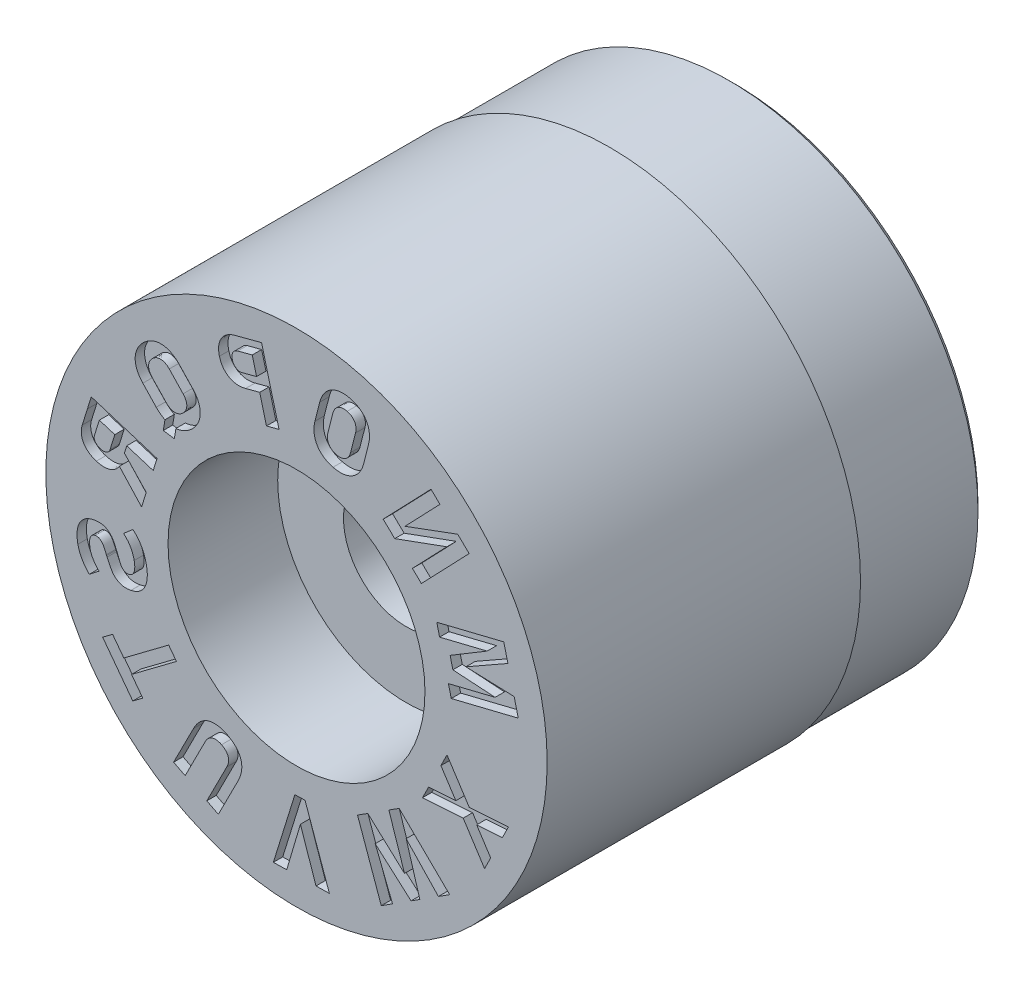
from build123d import *

# Parameters (mm, degrees)
SKETCH4_W          = 4
SKETCH4_H          = 1
CUT_EXTRUDE1_DEPTH = 0.3


with BuildPart() as part:
    # Sketch1 → Revolve1 (revolve)
    with BuildSketch(Plane(origin=(0, 0, 0), x_dir=(0, 0, -1), z_dir=(1, 0, 0)), mode=Mode.PRIVATE) as revolve1_sk:
        Polygon((0, 8), (0, 4.1), (3.5, 4.1), (3.5, 2), (14, 2), (14, 7.75), (13.75, 8), align=None)
    revolve(revolve1_sk.sketch.rotate(Axis((0, 0, 3.797909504), (0, 0, -1)), 90), axis=Axis((0, 0, 3.797909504), (0, 0, -1)))

    # Sketch4 → Cut-Revolve1 (revolve, cut)
    with BuildSketch(Plane(origin=(0, 0, 0), x_dir=(0, 0, -1), z_dir=(1, 0, 0)), mode=Mode.PRIVATE) as cut_revolve1_sk:
        with Locations((12, 8.435)):
            Rectangle(SKETCH4_W, SKETCH4_H)
    revolve(cut_revolve1_sk.sketch.rotate(Axis((0, 0, 0), (0, 0, -1)), 90), axis=Axis((0, 0, 0), (0, 0, -1)), mode=Mode.SUBTRACT)

    # Sketch6 → Cut-Extrude1 (cut)
    # profile 1 of 12: a face of its own
    with BuildSketch(Plane.XY):
        with BuildLine():
            add(Edge.make_bspline(
                [(-1.965228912, 6.820802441), (-2.027669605, 6.803893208), (-2.117857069, 6.771430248), (-2.224547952, 6.706108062), (-2.293665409, 6.649907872), (-2.353723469, 6.586716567), (-2.403129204, 6.516614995), (-2.441362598, 6.440165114), (-2.468949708, 6.358337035), (-2.485065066, 6.271958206), (-2.491609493, 6.149519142), (-2.475734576, 6.056826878), (-2.460282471, 5.995635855)],
                knots=[0, 0, 0, 0, 0.179476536, 0.263146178, 0.345423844, 0.425558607, 0.503885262, 0.582071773, 0.66151822, 0.742295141, 0.82474757, 1, 1, 1, 1], degree=3))
            add(Edge.make_bspline(
                [(-2.460282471, 5.995635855), (-2.444379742, 5.934477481), (-2.411500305, 5.846642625), (-2.345882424, 5.743255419), (-2.289451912, 5.676219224), (-2.225482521, 5.618657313), (-2.15454543, 5.571934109), (-2.077506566, 5.535120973), (-1.994242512, 5.509904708), (-1.906395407, 5.494923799), (-1.781395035, 5.491759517), (-1.686884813, 5.506795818), (-1.624244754, 5.523231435)],
                knots=[0, 0, 0, 0, 0.17551905, 0.257739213, 0.338753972, 0.417967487, 0.495681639, 0.57368959, 0.654075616, 0.736334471, 0.820262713, 1, 1, 1, 1], degree=3))
            Line((-1.624244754, 5.523231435), (-1.173858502, 5.641810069))
            Line((-1.173858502, 5.641810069), (-0.95771674, 4.819775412))
            Line((-0.95771674, 4.819775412), (-0.557998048, 4.924640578))
            Line((-0.557998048, 4.924640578), (-1.115303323, 7.044195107))
            Line((-1.115303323, 7.044195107), (-1.515022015, 6.93932994))
            Line((-1.515022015, 6.93932994), (-1.965228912, 6.820802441))
        make_face()
        with BuildLine():
            add(Edge.make_bspline(
                [(-1.735625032, 5.905345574), (-1.75822534, 5.899329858), (-1.792496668, 5.894446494), (-1.837853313, 5.897237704), (-1.870092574, 5.904183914), (-1.900775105, 5.915861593), (-1.92994226, 5.930834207), (-1.956224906, 5.951169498), (-1.980473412, 5.974941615), (-2.002429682, 6.002311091), (-2.02667756, 6.044941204), (-2.040136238, 6.079869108), (-2.046313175, 6.104452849)],
                knots=[0, 0, 0, 0, 0.169219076, 0.248096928, 0.327749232, 0.406804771, 0.485094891, 0.564039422, 0.646177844, 0.73044534, 0.816958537, 1, 1, 1, 1], degree=3))
            add(Edge.make_bspline(
                [(-2.046313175, 6.104452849), (-2.053532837, 6.129238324), (-2.058849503, 6.166765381), (-2.059367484, 6.216406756), (-2.053927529, 6.25115221), (-2.045654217, 6.284270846), (-2.031957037, 6.314520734), (-2.015143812, 6.342733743), (-1.993580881, 6.36756535), (-1.968697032, 6.389425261), (-1.930368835, 6.414842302), (-1.897247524, 6.426875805), (-1.874444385, 6.433202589)],
                knots=[0, 0, 0, 0, 0.18458373, 0.271052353, 0.355147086, 0.436297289, 0.51523441, 0.592529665, 0.671240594, 0.750119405, 0.8296662, 1, 1, 1, 1], degree=3))
            Line((-1.874444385, 6.433202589), (-1.413835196, 6.554494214))
            Line((-1.413835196, 6.554494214), (-1.275041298, 6.026630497))
            Line((-1.275041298, 6.026630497), (-1.735625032, 5.905345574))
        make_face(mode=Mode.SUBTRACT)
    # profile 2 of 12: a face of its own
    with BuildSketch(Plane.XY):
        with BuildLine():
            Line((-3.898808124, 2.99632497), (-3.848131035, 3.305995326))
            add(Edge.make_bspline(
                [(-3.848131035, 3.305995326), (-3.836792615, 3.30666712), (-3.808727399, 3.308923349), (-3.76389009, 3.316186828), (-3.713731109, 3.327202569), (-3.664013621, 3.342340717), (-3.614915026, 3.360230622), (-3.566897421, 3.382208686), (-3.519676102, 3.407628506), (-3.473386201, 3.436632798), (-3.412052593, 3.480297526), (-3.36871918, 3.517501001), (-3.340797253, 3.543995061)],
                knots=[0.553499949, 0.553499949, 0.553499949, 0.553499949, 0.580086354, 0.619413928, 0.659745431, 0.700258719, 0.74101763, 0.782026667, 0.823799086, 0.866516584, 0.909857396, 1, 1, 1, 1], degree=3))
            add(Edge.make_bspline(
                [(-3.340797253, 3.543995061), (-3.312558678, 3.570190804), (-3.273318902, 3.611901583), (-3.226667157, 3.671047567), (-3.195497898, 3.715946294), (-3.167230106, 3.761432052), (-3.143386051, 3.808577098), (-3.122255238, 3.856382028), (-3.104941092, 3.905319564), (-3.091162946, 3.954710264), (-3.0808539, 4.004408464), (-3.074020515, 4.054167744), (-3.071757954, 4.104155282), (-3.071897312, 4.154171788), (-3.076831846, 4.204157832), (-3.084373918, 4.254441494), (-3.096105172, 4.304561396), (-3.11163789, 4.354297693), (-3.129980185, 4.403650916), (-3.152902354, 4.451817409), (-3.178562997, 4.499436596), (-3.207760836, 4.546100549), (-3.252042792, 4.608031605), (-3.289792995, 4.652001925), (-3.316725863, 4.680383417)],
                knots=[0, 0, 0, 0, 0.090196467, 0.133907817, 0.176363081, 0.218191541, 0.259249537, 0.300021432, 0.340564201, 0.380741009, 0.420055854, 0.459394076, 0.498255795, 0.537194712, 0.576458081, 0.615802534, 0.656246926, 0.696896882, 0.737812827, 0.77947539, 0.821746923, 0.864482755, 0.90833409, 1, 1, 1, 1], degree=3))
            Line((-3.316725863, 4.680383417), (-3.74388665, 5.130616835))
            add(Edge.make_bspline(
                [(-3.74388665, 5.130616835), (-3.770222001, 5.159500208), (-3.81291853, 5.198578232), (-3.872411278, 5.24619899), (-3.917217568, 5.278430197), (-3.963631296, 5.306189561), (-4.010475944, 5.331545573), (-4.058678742, 5.352720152), (-4.107658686, 5.370674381), (-4.157187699, 5.384857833), (-4.206837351, 5.395779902), (-4.256809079, 5.40212696), (-4.306709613, 5.40604489), (-4.356685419, 5.405124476), (-4.406738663, 5.401715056), (-4.456773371, 5.393847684), (-4.506882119, 5.382581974), (-4.556474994, 5.367549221), (-4.605570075, 5.349642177), (-4.653588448, 5.327668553), (-4.700810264, 5.302248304), (-4.747097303, 5.273241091), (-4.808532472, 5.229531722), (-4.851868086, 5.192170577), (-4.88013629, 5.165904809)],
                knots=[0, 0, 0, 0, 0.0914447, 0.13535298, 0.178471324, 0.220602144, 0.261946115, 0.303163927, 0.34380239, 0.384051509, 0.423761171, 0.462745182, 0.501957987, 0.540891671, 0.579708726, 0.619390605, 0.659396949, 0.699922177, 0.740693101, 0.781714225, 0.823498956, 0.866229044, 0.90958263, 1, 1, 1, 1], degree=3))
            add(Edge.make_bspline(
                [(-4.88013629, 5.165904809), (-4.907918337, 5.139265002), (-4.947443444, 5.09802481), (-4.994484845, 5.039170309), (-5.025268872, 4.99422696), (-5.053191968, 4.948572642), (-5.077637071, 4.901898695), (-5.098618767, 4.85394683), (-5.115976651, 4.805031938), (-5.129791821, 4.755497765), (-5.140054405, 4.705779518), (-5.146715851, 4.655878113), (-5.149996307, 4.60590851), (-5.148630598, 4.555779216), (-5.144914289, 4.505676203), (-5.136359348, 4.455513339), (-5.124792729, 4.405214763), (-5.109437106, 4.35525679), (-5.090864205, 4.305929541), (-5.068607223, 4.257532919), (-5.042804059, 4.210056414), (-5.013654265, 4.163370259), (-4.96935461, 4.101447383), (-4.931615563, 4.057471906), (-4.904678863, 4.029092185)],
                knots=[0, 0, 0, 0, 0.090160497, 0.133576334, 0.176319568, 0.217664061, 0.258857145, 0.299619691, 0.340153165, 0.38032076, 0.419972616, 0.458952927, 0.498157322, 0.537110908, 0.576316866, 0.615725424, 0.656160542, 0.697129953, 0.738036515, 0.779525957, 0.821787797, 0.86451383, 0.908355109, 1, 1, 1, 1], degree=3))
            Line((-4.904678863, 4.029092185), (-4.477518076, 3.578858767))
            add(Edge.make_bspline(
                [(-4.477518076, 3.578858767), (-4.451184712, 3.549971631), (-4.408482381, 3.510904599), (-4.348998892, 3.463266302), (-4.304167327, 3.431082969), (-4.257898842, 3.40318279), (-4.222191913, 3.38446494), (-4.202019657, 3.374934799), (-4.197735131, 3.372956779)],
                knots=[0, 0, 0, 0, 0.091417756, 0.135313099, 0.178418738, 0.220537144, 0.261722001, 0.272770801, 0.272770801, 0.272770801, 0.272770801], degree=3))
            Line((-4.197735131, 3.372956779), (-4.25122275, 3.048011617))
            Line((-4.25122275, 3.048011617), (-3.898808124, 2.99632497))
        make_face()
        with BuildLine():
            Line((-4.061062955, 4.843741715), (-3.619430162, 4.378383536))
            add(Edge.make_bspline(
                [(-3.619430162, 4.378383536), (-3.594708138, 4.35211299), (-3.561810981, 4.309944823), (-3.529908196, 4.247915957), (-3.512665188, 4.201131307), (-3.503244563, 4.153490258), (-3.500094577, 4.105904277), (-3.503993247, 4.058780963), (-3.514520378, 4.012101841), (-3.532397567, 3.966696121), (-3.565574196, 3.907208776), (-3.5996465, 3.867683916), (-3.625005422, 3.843522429)],
                knots=[0, 0, 0, 0, 0.1797866, 0.264153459, 0.346527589, 0.427206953, 0.505113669, 0.58328295, 0.661826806, 0.742543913, 0.825414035, 1, 1, 1, 1], degree=3))
            add(Edge.make_bspline(
                [(-3.625005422, 3.843522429), (-3.650838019, 3.819714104), (-3.691526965, 3.78664743), (-3.753151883, 3.757436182), (-3.799450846, 3.742040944), (-3.846633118, 3.733826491), (-3.894047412, 3.731978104), (-3.941233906, 3.737842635), (-3.987998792, 3.750269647), (-4.033864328, 3.769338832), (-4.094029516, 3.804837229), (-4.134835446, 3.83951024), (-4.159422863, 3.866134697)],
                knots=[0, 0, 0, 0, 0.175488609, 0.257693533, 0.338212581, 0.417590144, 0.495224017, 0.573485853, 0.653269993, 0.735363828, 0.819848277, 1, 1, 1, 1], degree=3))
            Line((-4.159422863, 3.866134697), (-4.601055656, 4.331492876))
            add(Edge.make_bspline(
                [(-4.601055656, 4.331492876), (-4.62618204, 4.357565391), (-4.659022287, 4.399882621), (-4.691082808, 4.461970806), (-4.708031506, 4.508708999), (-4.718369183, 4.556053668), (-4.721228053, 4.603575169), (-4.717527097, 4.650890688), (-4.706348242, 4.697613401), (-4.688587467, 4.742990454), (-4.655795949, 4.802728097), (-4.621238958, 4.84193479), (-4.595928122, 4.86637744)],
                knots=[0, 0, 0, 0, 0.180140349, 0.264432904, 0.346734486, 0.426812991, 0.504651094, 0.582751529, 0.662087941, 0.742733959, 0.824536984, 1, 1, 1, 1], degree=3))
            add(Edge.make_bspline(
                [(-4.595928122, 4.86637744), (-4.570463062, 4.890636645), (-4.529037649, 4.922396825), (-4.467925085, 4.952607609), (-4.42159703, 4.967688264), (-4.374626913, 4.976358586), (-4.32736217, 4.977167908), (-4.279985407, 4.972240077), (-4.233067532, 4.959654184), (-4.187071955, 4.940567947), (-4.126793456, 4.905010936), (-4.085981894, 4.870184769), (-4.061062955, 4.843741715)],
                knots=[0, 0, 0, 0, 0.174978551, 0.257511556, 0.338000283, 0.41662375, 0.494167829, 0.572354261, 0.65283612, 0.73489904, 0.819351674, 1, 1, 1, 1], degree=3))
        make_face(mode=Mode.SUBTRACT)
    # profile 3 of 12: a face of its own
    with BuildSketch(Plane.XY):
        with BuildLine():
            Line((-5.492865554, 1.801806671), (-5.418265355, 2.041869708))
            Line((-5.418265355, 2.041869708), (-4.573896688, 1.77964272))
            Line((-4.573896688, 1.77964272), (-4.451133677, 2.175242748))
            Line((-4.451133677, 2.175242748), (-6.55129686, 2.827469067))
            Line((-6.55129686, 2.827469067), (-6.674059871, 2.431869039))
            Line((-6.674059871, 2.431869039), (-6.673924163, 2.431826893))
            Line((-6.673924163, 2.431826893), (-6.836694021, 1.90803437))
            add(Edge.make_bspline(
                [(-6.836694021, 1.90803437), (-6.854124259, 1.853272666), (-6.869861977, 1.76951945), (-6.868384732, 1.658193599), (-6.855413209, 1.579110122), (-6.831343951, 1.503596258), (-6.797315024, 1.432220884), (-6.752244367, 1.366177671), (-6.697310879, 1.305514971), (-6.632723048, 1.251060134), (-6.533180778, 1.185050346), (-6.447648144, 1.151459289), (-6.388794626, 1.132454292)],
                knots=[0, 0, 0, 0, 0.170945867, 0.251282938, 0.330228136, 0.408509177, 0.4863951, 0.564684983, 0.645585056, 0.729174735, 0.815467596, 1, 1, 1, 1], degree=3))
            add(Edge.make_bspline(
                [(-6.388794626, 1.132454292), (-6.329832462, 1.113956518), (-6.240421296, 1.094817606), (-6.121394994, 1.091630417), (-6.037411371, 1.10063539), (-5.957823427, 1.119740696), (-5.883010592, 1.148386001), (-5.814592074, 1.1884327), (-5.751946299, 1.237351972), (-5.69727695, 1.293924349), (-5.666971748, 1.336269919), (-5.653565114, 1.357693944)],
                knots=[0, 0, 0, 0, 0.184189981, 0.270383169, 0.35373301, 0.435075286, 0.513611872, 0.591479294, 0.670334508, 0.749749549, 0.824975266, 0.824975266, 0.824975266, 0.824975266], degree=3))
            Line((-5.653565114, 1.357693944), (-4.944014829, 0.587025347))
            Line((-4.944014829, 0.587025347), (-4.795111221, 1.066422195))
            Line((-4.795111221, 1.066422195), (-5.492865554, 1.801806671))
        make_face()
        with BuildLine():
            Line((-6.293269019, 2.313610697), (-5.799511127, 2.16026933))
            Line((-5.799511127, 2.16026933), (-5.952642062, 1.667694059))
            add(Edge.make_bspline(
                [(-5.952642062, 1.667694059), (-5.957948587, 1.648236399), (-5.970874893, 1.621207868), (-5.994526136, 1.589680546), (-6.015438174, 1.569777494), (-6.039072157, 1.553071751), (-6.065216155, 1.539633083), (-6.094066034, 1.530750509), (-6.124831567, 1.525116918), (-6.157463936, 1.522972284), (-6.204050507, 1.525701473), (-6.239257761, 1.532529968), (-6.262627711, 1.539319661)],
                knots=[0, 0, 0, 0, 0.160082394, 0.236396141, 0.313016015, 0.389134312, 0.466417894, 0.546230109, 0.628768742, 0.715268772, 0.806175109, 1, 1, 1, 1], degree=3))
            add(Edge.make_bspline(
                [(-6.262627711, 1.539319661), (-6.28571981, 1.546841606), (-6.319058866, 1.559810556), (-6.358851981, 1.584063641), (-6.38446639, 1.604449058), (-6.406566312, 1.626706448), (-6.425343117, 1.650477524), (-6.439719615, 1.676217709), (-6.450000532, 1.703463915), (-6.45571744, 1.731841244), (-6.458550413, 1.771559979), (-6.452035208, 1.801519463), (-6.446397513, 1.821043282)],
                knots=[0, 0, 0, 0, 0.193075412, 0.282174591, 0.368977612, 0.452272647, 0.530685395, 0.608675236, 0.685354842, 0.760869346, 0.837759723, 1, 1, 1, 1], degree=3))
            Line((-6.446397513, 1.821043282), (-6.293269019, 2.313610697))
        make_face(mode=Mode.SUBTRACT)
    # profile 4 of 12: a face of its own
    with BuildSketch(Plane.XY):
        with BuildLine():
            Line((0.74185494, 6.327821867), (0.588099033, 5.724645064))
            add(Edge.make_bspline(
                [(0.588099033, 5.724645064), (0.578232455, 5.686753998), (0.567465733, 5.629720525), (0.557922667, 5.553813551), (0.555566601, 5.498501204), (0.556040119, 5.444251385), (0.559980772, 5.391023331), (0.567780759, 5.338720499), (0.57865632, 5.287532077), (0.593434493, 5.237881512), (0.610513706, 5.189822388), (0.631288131, 5.143781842), (0.6555381, 5.099835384), (0.682356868, 5.057344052), (0.712232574, 5.016722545), (0.745892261, 4.978524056), (0.781949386, 4.94174782), (0.821430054, 4.907757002), (0.862792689, 4.875562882), (0.907439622, 4.846989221), (0.954070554, 4.820536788), (1.00309194, 4.7963234), (1.072850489, 4.767486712), (1.127676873, 4.750321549), (1.165272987, 4.740944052)],
                knots=[0, 0, 0, 0, 0.09133961, 0.135404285, 0.178489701, 0.2204833, 0.26201778, 0.302985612, 0.343862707, 0.384085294, 0.423845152, 0.462863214, 0.501862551, 0.540942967, 0.580112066, 0.619442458, 0.65971949, 0.700257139, 0.740985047, 0.781988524, 0.823881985, 0.866114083, 0.909549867, 1, 1, 1, 1], degree=3))
            add(Edge.make_bspline(
                [(1.165272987, 4.740944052), (1.202963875, 4.731961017), (1.259202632, 4.719478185), (1.334440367, 4.711924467), (1.3890191, 4.709120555), (1.442688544, 4.709979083), (1.495516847, 4.714082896), (1.547426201, 4.722096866), (1.598207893, 4.733208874), (1.647609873, 4.748106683), (1.695215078, 4.765891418), (1.741141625, 4.786973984), (1.78498007, 4.811209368), (1.826983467, 4.838897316), (1.86722734, 4.869340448), (1.905626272, 4.903031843), (1.942051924, 4.939772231), (1.976382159, 4.979258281), (2.008097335, 5.021508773), (2.037162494, 5.066318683), (2.063357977, 5.113803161), (2.087322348, 5.163586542), (2.116961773, 5.234011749), (2.133203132, 5.289814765), (2.143334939, 5.32764774)],
                knots=[0, 0, 0, 0, 0.090553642, 0.134089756, 0.176390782, 0.218072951, 0.259307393, 0.299989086, 0.340594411, 0.380562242, 0.42034234, 0.459141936, 0.49842787, 0.53715996, 0.576489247, 0.616140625, 0.656308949, 0.697181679, 0.738191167, 0.779537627, 0.821765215, 0.864700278, 0.908478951, 1, 1, 1, 1], degree=3))
            Line((2.143334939, 5.32764774), (2.297090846, 5.930824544))
            add(Edge.make_bspline(
                [(2.297090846, 5.930824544), (2.306958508, 5.968715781), (2.317722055, 6.025748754), (2.327270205, 6.101656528), (2.32961244, 6.156966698), (2.329188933, 6.211224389), (2.325072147, 6.264336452), (2.317963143, 6.316659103), (2.306717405, 6.367781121), (2.292693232, 6.417670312), (2.274731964, 6.465510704), (2.254732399, 6.511879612), (2.230172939, 6.555620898), (2.204019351, 6.598317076), (2.173358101, 6.638349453), (2.140348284, 6.677021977), (2.103784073, 6.713322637), (2.064604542, 6.747356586), (2.023088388, 6.779366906), (1.9788412, 6.808559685), (1.932030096, 6.835091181), (1.882569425, 6.858734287), (1.812796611, 6.887908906), (1.757831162, 6.904716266), (1.720314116, 6.91431766)],
                knots=[0, 0, 0, 0, 0.091341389, 0.135406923, 0.178493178, 0.220487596, 0.262022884, 0.302787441, 0.343665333, 0.384140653, 0.423666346, 0.462901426, 0.501901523, 0.540680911, 0.579699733, 0.619483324, 0.65932349, 0.699861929, 0.740590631, 0.781629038, 0.823523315, 0.866115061, 0.909551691, 1, 1, 1, 1], degree=3))
            add(Edge.make_bspline(
                [(1.720314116, 6.91431766), (1.682992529, 6.924535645), (1.626615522, 6.93499756), (1.551583, 6.943631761), (1.496836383, 6.946678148), (1.443091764, 6.945238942), (1.390351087, 6.940897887), (1.33854697, 6.9330011), (1.287707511, 6.921699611), (1.238241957, 6.907378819), (1.190602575, 6.889351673), (1.144771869, 6.868395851), (1.100670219, 6.844453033), (1.058820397, 6.816744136), (1.018573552, 6.786315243), (0.98002814, 6.752564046), (0.943675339, 6.715554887), (0.90915901, 6.676036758), (0.877619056, 6.633650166), (0.847894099, 6.589255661), (0.821870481, 6.541641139), (0.797856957, 6.491890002), (0.76823555, 6.421452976), (0.751982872, 6.365657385), (0.74185494, 6.327821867)],
                knots=[0, 0, 0, 0, 0.090234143, 0.133639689, 0.17625437, 0.218101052, 0.259037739, 0.299716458, 0.340318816, 0.380534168, 0.41981878, 0.459104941, 0.498097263, 0.536826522, 0.576152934, 0.615801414, 0.656300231, 0.697169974, 0.738176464, 0.77955374, 0.821778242, 0.864710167, 0.90848564, 1, 1, 1, 1], degree=3))
        make_face()
        with BuildLine():
            Line((1.884333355, 6.047162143), (1.724986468, 5.42363406))
            add(Edge.make_bspline(
                [(1.724986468, 5.42363406), (1.715837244, 5.388477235), (1.697526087, 5.337875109), (1.66190347, 5.277424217), (1.631164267, 5.238037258), (1.596371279, 5.20390792), (1.557194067, 5.176458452), (1.515063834, 5.154453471), (1.469778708, 5.138464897), (1.42169602, 5.129887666), (1.353581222, 5.125498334), (1.301837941, 5.134394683), (1.26756284, 5.142330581)],
                knots=[0, 0, 0, 0, 0.180265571, 0.264874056, 0.347008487, 0.427398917, 0.505624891, 0.583343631, 0.662522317, 0.742738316, 0.824849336, 1, 1, 1, 1], degree=3))
            add(Edge.make_bspline(
                [(1.26756284, 5.142330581), (1.233496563, 5.151314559), (1.184220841, 5.169067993), (1.126007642, 5.204898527), (1.088465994, 5.236287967), (1.05626572, 5.271829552), (1.029847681, 5.311365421), (1.008972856, 5.354236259), (0.99451692, 5.400757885), (0.986699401, 5.450048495), (0.983587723, 5.520203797), (0.992838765, 5.573334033), (1.001461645, 5.608496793)],
                knots=[0, 0, 0, 0, 0.174984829, 0.257482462, 0.337888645, 0.416930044, 0.494550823, 0.57298153, 0.65265653, 0.735237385, 0.819920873, 1, 1, 1, 1], degree=3))
            Line((1.001461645, 5.608496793), (1.160808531, 6.232024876))
            add(Edge.make_bspline(
                [(1.160808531, 6.232024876), (1.1706143, 6.266869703), (1.187229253, 6.318175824), (1.223943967, 6.377844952), (1.254355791, 6.417281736), (1.289263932, 6.451182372), (1.327968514, 6.479155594), (1.370143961, 6.501016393), (1.415516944, 6.516915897), (1.463587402, 6.526099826), (1.53178508, 6.530253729), (1.583488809, 6.521647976), (1.617627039, 6.513139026)],
                knots=[0, 0, 0, 0, 0.180450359, 0.264422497, 0.346616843, 0.427065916, 0.505014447, 0.582789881, 0.662026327, 0.742762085, 0.824933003, 1, 1, 1, 1], degree=3))
            add(Edge.make_bspline(
                [(1.617627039, 6.513139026), (1.652065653, 6.505106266), (1.700874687, 6.486216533), (1.759185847, 6.450598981), (1.796762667, 6.419199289), (1.82872208, 6.383597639), (1.855887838, 6.344508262), (1.875999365, 6.301108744), (1.891037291, 6.254765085), (1.899320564, 6.205568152), (1.901202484, 6.135532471), (1.893625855, 6.082351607), (1.884333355, 6.047162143)],
                knots=[0, 0, 0, 0, 0.175068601, 0.257563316, 0.337966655, 0.417005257, 0.494272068, 0.573143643, 0.653341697, 0.735328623, 0.819641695, 1, 1, 1, 1], degree=3))
        make_face(mode=Mode.SUBTRACT)
    # profile 5 of 12: a face of its own
    with BuildSketch(Plane.XY):
        Polygon((3.698792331, 3.212255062), (3.985757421, 2.937022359), (5.51139954, 4.52724692), (5.144638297, 4.879154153), (3.460985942, 4.256829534), (4.578646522, 5.421860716), (4.292147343, 5.696663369), (2.766505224, 4.106438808), (3.135130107, 3.752811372), (4.798532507, 4.358802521), align=None)
    # profile 6 of 12: a face of its own
    with BuildSketch(Plane.XY):
        Polygon((6.946849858, 1.2929693), (5.40516638, 1.34508153), (6.746399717, 2.107480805), (6.615723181, 2.638711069), (4.477032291, 2.112342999), (4.566980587, 1.74600869), (6.085205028, 2.119407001), (4.902630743, 1.410054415), (4.990182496, 1.05410404), (6.338693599, 0.968114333), (4.848887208, 0.601705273), (4.938835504, 0.235370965), (7.077526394, 0.761739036), align=None)
    # profile 7 of 12: a face of its own
    with BuildSketch(Plane.XY):
        Polygon((4.21433986, -2.575908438), (4.019242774, -2.96861894), (5.319760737, -2.879839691), (6.002380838, -3.934316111), (6.197477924, -3.541605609), (5.749703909, -2.850450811), (6.569312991, -2.794301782), (6.764410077, -2.401591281), (5.513738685, -2.486816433), (4.803894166, -1.390042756), (4.60879708, -1.782753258), (5.084329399, -2.516195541), align=None)
    # profile 8 of 12: a face of its own
    with BuildSketch(Plane.XY):
        Polygon((3.064173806, -6.377740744), (2.511931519, -4.989471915), (3.656326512, -5.998672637), (3.936159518, -5.819639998), (3.500314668, -4.357381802), (4.528718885, -5.440760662), (4.887917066, -5.211080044), (3.276852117, -3.632331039), (2.947976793, -3.842475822), (3.447203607, -5.346018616), (2.275863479, -4.272409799), (1.947394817, -4.482743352), (2.704975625, -6.607421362), align=None)
    # profile 9 of 12: a face of its own
    with BuildSketch(Plane.XY):
        Polygon((0.272622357, -4.910983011), (-0.051530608, -4.917522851), (-0.739380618, -7.132269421), (-0.312552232, -7.123769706), (0.125048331, -5.646634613), (0.62224102, -7.104794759), (1.049069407, -7.096295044), align=None)
    # profile 10 of 12: a face of its own
    with BuildSketch(Plane.XY):
        with BuildLine():
            Line((-2.494128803, -6.681305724), (-1.860236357, -5.433554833))
            add(Edge.make_bspline(
                [(-1.860236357, -5.433554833), (-1.841860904, -5.396436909), (-1.816023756, -5.340916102), (-1.789053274, -5.265209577), (-1.772766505, -5.210115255), (-1.760102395, -5.155839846), (-1.75110411, -5.102368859), (-1.745811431, -5.049712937), (-1.743987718, -4.997728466), (-1.746641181, -4.946735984), (-1.751696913, -4.896801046), (-1.761060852, -4.848054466), (-1.774049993, -4.800733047), (-1.791126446, -4.754613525), (-1.811079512, -4.709531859), (-1.83538307, -4.665954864), (-1.862986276, -4.623596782), (-1.894070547, -4.582664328), (-1.928501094, -4.543277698), (-1.966121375, -4.505415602), (-2.007597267, -4.469612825), (-2.052210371, -4.435073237), (-2.117458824, -4.390616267), (-2.169511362, -4.360430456), (-2.206052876, -4.342325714)],
                knots=[0, 0, 0, 0, 0.095524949, 0.140911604, 0.185147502, 0.227894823, 0.269309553, 0.310049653, 0.349812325, 0.38908245, 0.427668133, 0.465422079, 0.503364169, 0.540653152, 0.578693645, 0.616894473, 0.655533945, 0.695157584, 0.735267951, 0.776048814, 0.818086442, 0.861479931, 0.906043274, 1, 1, 1, 1], degree=3))
            add(Edge.make_bspline(
                [(-2.206052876, -4.342325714), (-2.242565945, -4.324216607), (-2.297231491, -4.298947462), (-2.371586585, -4.272450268), (-2.425813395, -4.257130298), (-2.47913835, -4.244736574), (-2.531908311, -4.236494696), (-2.583982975, -4.232431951), (-2.635198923, -4.231361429), (-2.685503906, -4.234176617), (-2.734782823, -4.240642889), (-2.782884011, -4.250854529), (-2.829855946, -4.264522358), (-2.875728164, -4.281694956), (-2.920117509, -4.303466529), (-2.963848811, -4.327824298), (-3.005918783, -4.356666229), (-3.046718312, -4.388668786), (-3.086041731, -4.424201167), (-3.123767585, -4.462919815), (-3.16007978, -4.505133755), (-3.194575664, -4.550963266), (-3.239319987, -4.617794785), (-3.269529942, -4.671110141), (-3.288198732, -4.708160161)],
                knots=[0, 0, 0, 0, 0.094114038, 0.138797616, 0.182063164, 0.224120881, 0.265100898, 0.305212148, 0.34460795, 0.383264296, 0.421395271, 0.459223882, 0.496654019, 0.534231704, 0.572121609, 0.610674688, 0.649680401, 0.689720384, 0.730293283, 0.771920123, 0.81442815, 0.858737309, 0.90424292, 1, 1, 1, 1], degree=3))
            Line((-3.288198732, -4.708160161), (-3.922091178, -5.955911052))
            Line((-3.922091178, -5.955911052), (-3.553647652, -6.143048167))
            Line((-3.553647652, -6.143048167), (-2.915066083, -4.885759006))
            add(Edge.make_bspline(
                [(-2.915066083, -4.885759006), (-2.901393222, -4.85945441), (-2.879611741, -4.821540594), (-2.844334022, -4.777006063), (-2.817647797, -4.747593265), (-2.788767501, -4.722579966), (-2.75820867, -4.701557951), (-2.72645343, -4.683392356), (-2.692632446, -4.670226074), (-2.657880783, -4.660269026), (-2.622093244, -4.654623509), (-2.585474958, -4.653353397), (-2.548097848, -4.65547681), (-2.509759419, -4.662173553), (-2.456367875, -4.677453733), (-2.416742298, -4.693363), (-2.390991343, -4.706939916)],
                knots=[0, 0, 0, 0, 0.141478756, 0.207311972, 0.270439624, 0.33046649, 0.3888791, 0.447000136, 0.504343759, 0.561354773, 0.619002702, 0.67647883, 0.735654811, 0.797097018, 0.861493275, 1, 1, 1, 1], degree=3))
            add(Edge.make_bspline(
                [(-2.390991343, -4.706939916), (-2.364796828, -4.720108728), (-2.328115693, -4.742405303), (-2.284124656, -4.776929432), (-2.256058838, -4.804040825), (-2.231325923, -4.832691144), (-2.211344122, -4.863671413), (-2.194013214, -4.895855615), (-2.181667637, -4.930059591), (-2.172335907, -4.965206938), (-2.167935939, -5.001560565), (-2.166737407, -5.03877187), (-2.1702712, -5.076875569), (-2.177757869, -5.115743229), (-2.192735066, -5.170419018), (-2.210369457, -5.210428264), (-2.22399076, -5.236879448)],
                knots=[0, 0, 0, 0, 0.139145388, 0.203188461, 0.265137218, 0.324189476, 0.382447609, 0.439852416, 0.497362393, 0.554683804, 0.612167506, 0.670826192, 0.731173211, 0.793426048, 0.858591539, 1, 1, 1, 1], degree=3))
            Line((-2.22399076, -5.236879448), (-2.862572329, -6.494168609))
            Line((-2.862572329, -6.494168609), (-2.494128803, -6.681305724))
        make_face()
    # profile 11 of 12: a face of its own
    with BuildSketch(Plane.XY):
        Polygon((-5.511301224, -3.869996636), (-5.868747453, -3.39350658), (-6.187148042, -3.631916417), (-5.224947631, -4.914567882), (-4.906547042, -4.676158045), (-5.263944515, -4.199732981), (-3.831789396, -3.125586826), (-4.07899046, -2.795733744), align=None)
    # profile 12 of 12: a face of its own
    with BuildSketch(Plane.XY):
        with BuildLine():
            Line((-5.284909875, -1.8861092), (-5.281667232, -1.885736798))
            add(Edge.make_bspline(
                [(-5.281667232, -1.885736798), (-5.248507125, -1.879216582), (-5.200107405, -1.866382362), (-5.13843347, -1.843397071), (-5.095004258, -1.824387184), (-5.054592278, -1.801444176), (-5.016420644, -1.776515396), (-4.980456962, -1.749107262), (-4.947383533, -1.718718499), (-4.916674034, -1.686182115), (-4.888586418, -1.65112945), (-4.863694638, -1.613523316), (-4.840751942, -1.57398667), (-4.821680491, -1.531728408), (-4.804074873, -1.487647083), (-4.790130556, -1.440918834), (-4.778777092, -1.391980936), (-4.770444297, -1.34093374), (-4.764719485, -1.288000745), (-4.761537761, -1.2333286), (-4.761748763, -1.176772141), (-4.76448613, -1.118242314), (-4.773201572, -1.036302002), (-4.782911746, -0.974179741), (-4.791343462, -0.93244588)],
                knots=[0, 0, 0, 0, 0.083484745, 0.12338608, 0.162537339, 0.200455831, 0.238036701, 0.275113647, 0.312019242, 0.348869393, 0.385554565, 0.422827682, 0.460195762, 0.498343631, 0.53725041, 0.577385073, 0.618673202, 0.661291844, 0.705077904, 0.750158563, 0.796507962, 0.844738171, 0.894847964, 1, 1, 1, 1], degree=3))
            add(Edge.make_bspline(
                [(-4.791343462, -0.93244588), (-4.801536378, -0.881327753), (-4.820102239, -0.805527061), (-4.853739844, -0.707484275), (-4.882262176, -0.636039), (-4.914382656, -0.567082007), (-4.948994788, -0.500357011), (-4.987522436, -0.436946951), (-5.028948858, -0.376457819), (-5.073238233, -0.319781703), (-5.134993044, -0.249992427), (-5.185348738, -0.202454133), (-5.221017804, -0.173828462)],
                knots=[0, 0, 0, 0, 0.175952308, 0.262878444, 0.349633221, 0.435446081, 0.519509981, 0.603179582, 0.685678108, 0.766805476, 0.845757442, 1, 1, 1, 1], degree=3))
            Line((-5.221017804, -0.173828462), (-5.518402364, -0.429468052))
            add(Edge.make_bspline(
                [(-5.518402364, -0.429468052), (-5.47587883, -0.464609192), (-5.416045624, -0.523227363), (-5.34846018, -0.61291352), (-5.301822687, -0.685383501), (-5.261319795, -0.762455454), (-5.21569464, -0.869319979), (-5.191709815, -0.953246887), (-5.180393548, -1.01010454)],
                knots=[0, 0, 0, 0, 0.241780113, 0.365030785, 0.491421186, 0.619000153, 0.746040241, 1, 1, 1, 1], degree=3))
            add(Edge.make_bspline(
                [(-5.180393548, -1.01010454), (-5.174386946, -1.041542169), (-5.166952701, -1.087614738), (-5.161878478, -1.147872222), (-5.161139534, -1.189424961), (-5.163273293, -1.228577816), (-5.168086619, -1.265466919), (-5.175394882, -1.299954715), (-5.185604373, -1.332046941), (-5.197948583, -1.361423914), (-5.212836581, -1.387974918), (-5.230946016, -1.410836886), (-5.250509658, -1.431453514), (-5.273013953, -1.448656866), (-5.307154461, -1.467177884), (-5.335393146, -1.476257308), (-5.354945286, -1.480314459)],
                knots=[0, 0, 0, 0, 0.170981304, 0.248981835, 0.322798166, 0.392772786, 0.458216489, 0.521320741, 0.580802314, 0.637811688, 0.691297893, 0.742781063, 0.793195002, 0.842761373, 0.893358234, 1, 1, 1, 1], degree=3))
            Line((-5.354945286, -1.480314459), (-5.356359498, -1.480414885))
            add(Edge.make_bspline(
                [(-5.356359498, -1.480414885), (-5.382354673, -1.485178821), (-5.421950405, -1.489008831), (-5.471197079, -1.475675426), (-5.503452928, -1.459407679), (-5.53234296, -1.437369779), (-5.558707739, -1.411225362), (-5.5826504, -1.380728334), (-5.60380476, -1.345309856), (-5.623591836, -1.304826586), (-5.652044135, -1.240543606), (-5.672599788, -1.189011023), (-5.685806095, -1.152453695)],
                knots=[0, 0, 0, 0, 0.155444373, 0.225673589, 0.294851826, 0.36478315, 0.436631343, 0.510834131, 0.590193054, 0.67666585, 0.773414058, 1, 1, 1, 1], degree=3))
            add(Edge.make_bspline(
                [(-5.685806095, -1.152453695), (-5.687179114, -1.149986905), (-5.689962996, -1.145068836), (-5.690631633, -1.139456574), (-5.692153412, -1.137127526)],
                knots=[0, 0, 0, 0, 0.513305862, 1, 1, 1, 1], degree=3))
            Line((-5.692153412, -1.137127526), (-5.703362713, -1.105374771))
            add(Edge.make_bspline(
                [(-5.703362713, -1.105374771), (-5.726476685, -1.04074655), (-5.76414369, -0.949443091), (-5.818566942, -0.835954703), (-5.858823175, -0.763773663), (-5.902843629, -0.699039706), (-5.956648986, -0.643740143), (-6.018382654, -0.595121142), (-6.076544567, -0.561739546), (-6.127266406, -0.539424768), (-6.168627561, -0.526614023), (-6.212637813, -0.517255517), (-6.259366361, -0.512739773), (-6.308901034, -0.511167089), (-6.380601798, -0.514475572), (-6.435398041, -0.522863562), (-6.472513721, -0.530054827)],
                knots=[0, 0, 0, 0, 0.190510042, 0.274064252, 0.34931174, 0.419884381, 0.490700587, 0.562603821, 0.637467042, 0.67620248, 0.716262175, 0.757466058, 0.8009155, 0.84641873, 0.894987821, 1, 1, 1, 1], degree=3))
            Line((-6.472513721, -0.530054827), (-6.474342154, -0.530326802))
            add(Edge.make_bspline(
                [(-6.474342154, -0.530326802), (-6.508075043, -0.53713586), (-6.557174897, -0.550106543), (-6.619927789, -0.572446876), (-6.663520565, -0.592096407), (-6.704849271, -0.614037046), (-6.743920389, -0.638218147), (-6.779994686, -0.665632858), (-6.813816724, -0.694981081), (-6.845113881, -0.726961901), (-6.87325999, -0.761395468), (-6.898821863, -0.797958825), (-6.921675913, -0.83667201), (-6.94203911, -0.877430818), (-6.959513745, -0.92055191), (-6.974008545, -0.965775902), (-6.986101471, -1.013165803), (-6.995220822, -1.062476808), (-7.00112339, -1.113688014), (-7.00450372, -1.166722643), (-7.00501928, -1.221654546), (-7.002240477, -1.27843768), (-6.994999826, -1.357974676), (-6.985776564, -1.418275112), (-6.977373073, -1.458793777)],
                knots=[0, 0, 0, 0, 0.086172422, 0.12701908, 0.16671568, 0.205827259, 0.244168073, 0.281666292, 0.319192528, 0.356254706, 0.393601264, 0.430466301, 0.467900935, 0.506109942, 0.544492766, 0.584325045, 0.624979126, 0.666927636, 0.709832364, 0.754030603, 0.799989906, 0.847356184, 0.896374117, 1, 1, 1, 1], degree=3))
            add(Edge.make_bspline(
                [(-6.977373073, -1.458793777), (-6.969441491, -1.497836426), (-6.954692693, -1.556357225), (-6.927167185, -1.63255532), (-6.896083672, -1.709946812), (-6.848350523, -1.804369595), (-6.758313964, -1.949229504), (-6.674429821, -2.04696809), (-6.613401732, -2.106806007)],
                knots=[0, 0, 0, 0, 0.158593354, 0.239577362, 0.3222405, 0.490362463, 0.659789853, 1, 1, 1, 1], degree=3))
            Line((-6.613401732, -2.106806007), (-6.303013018, -1.866162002))
            add(Edge.make_bspline(
                [(-6.303013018, -1.866162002), (-6.339610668, -1.83109769), (-6.390018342, -1.774934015), (-6.449648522, -1.694698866), (-6.4891289, -1.633061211), (-6.52349165, -1.570440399), (-6.560434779, -1.487829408), (-6.579517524, -1.423860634), (-6.588322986, -1.381135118)],
                knots=[0, 0, 0, 0, 0.266218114, 0.395749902, 0.525007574, 0.650598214, 0.770805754, 1, 1, 1, 1], degree=3))
            add(Edge.make_bspline(
                [(-6.588322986, -1.381135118), (-6.594831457, -1.351772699), (-6.600464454, -1.308302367), (-6.605940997, -1.251829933), (-6.606213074, -1.212876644), (-6.60447697, -1.17615633), (-6.600660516, -1.141585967), (-6.593802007, -1.109348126), (-6.584953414, -1.079400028), (-6.573837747, -1.051857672), (-6.559713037, -1.027625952), (-6.544404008, -1.005686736), (-6.526242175, -0.986978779), (-6.50573957, -0.971307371), (-6.475539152, -0.953074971), (-6.449493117, -0.945833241), (-6.43204702, -0.94178694)],
                knots=[0, 0, 0, 0, 0.172938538, 0.252433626, 0.32660489, 0.397072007, 0.464128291, 0.526685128, 0.586647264, 0.643864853, 0.697243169, 0.747885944, 0.797620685, 0.846695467, 0.896243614, 1, 1, 1, 1], degree=3))
            Line((-6.43204702, -0.94178694), (-6.430632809, -0.941686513))
            add(Edge.make_bspline(
                [(-6.430632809, -0.941686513), (-6.402276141, -0.935484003), (-6.359681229, -0.933595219), (-6.305935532, -0.946229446), (-6.271486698, -0.964696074), (-6.240698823, -0.988318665), (-6.212693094, -1.015915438), (-6.187591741, -1.0470389), (-6.164987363, -1.082962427), (-6.143263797, -1.124765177), (-6.109499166, -1.194558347), (-6.085277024, -1.251736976), (-6.068437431, -1.292479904)],
                knots=[0, 0, 0, 0, 0.15643453, 0.226827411, 0.295562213, 0.365755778, 0.43592613, 0.507448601, 0.581240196, 0.664777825, 0.761812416, 1, 1, 1, 1], degree=3))
            add(Edge.make_bspline(
                [(-6.068437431, -1.292479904), (-6.066674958, -1.296132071), (-6.064178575, -1.30397943), (-6.061665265, -1.311820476), (-6.059830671, -1.315605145)],
                knots=[0, 0, 0, 0, 0.490920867, 1, 1, 1, 1], degree=3))
            add(Edge.make_bspline(
                [(-6.059830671, -1.315605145), (-6.057846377, -1.321104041), (-6.052639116, -1.331712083), (-6.047518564, -1.342361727), (-6.045449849, -1.347985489)],
                knots=[0, 0, 0, 0, 0.493683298, 1, 1, 1, 1], degree=3))
            add(Edge.make_bspline(
                [(-6.045449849, -1.347985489), (-6.020086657, -1.408510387), (-5.981854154, -1.49530328), (-5.923562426, -1.601432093), (-5.881715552, -1.670265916), (-5.835087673, -1.731011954), (-5.78028863, -1.782860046), (-5.718696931, -1.82785263), (-5.661550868, -1.858553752), (-5.612179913, -1.879047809), (-5.572128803, -1.890211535), (-5.529810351, -1.898302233), (-5.485368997, -1.903050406), (-5.438326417, -1.904070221), (-5.371006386, -1.90034623), (-5.319564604, -1.89319499), (-5.284909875, -1.8861092)],
                knots=[0, 0, 0, 0, 0.18973339, 0.273567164, 0.34974082, 0.422344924, 0.494075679, 0.566950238, 0.642148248, 0.680928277, 0.721189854, 0.762030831, 0.805316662, 0.850170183, 0.897837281, 1, 1, 1, 1], degree=3))
        make_face()
    extrude(amount=-CUT_EXTRUDE1_DEPTH, mode=Mode.SUBTRACT)


solid = part.part
